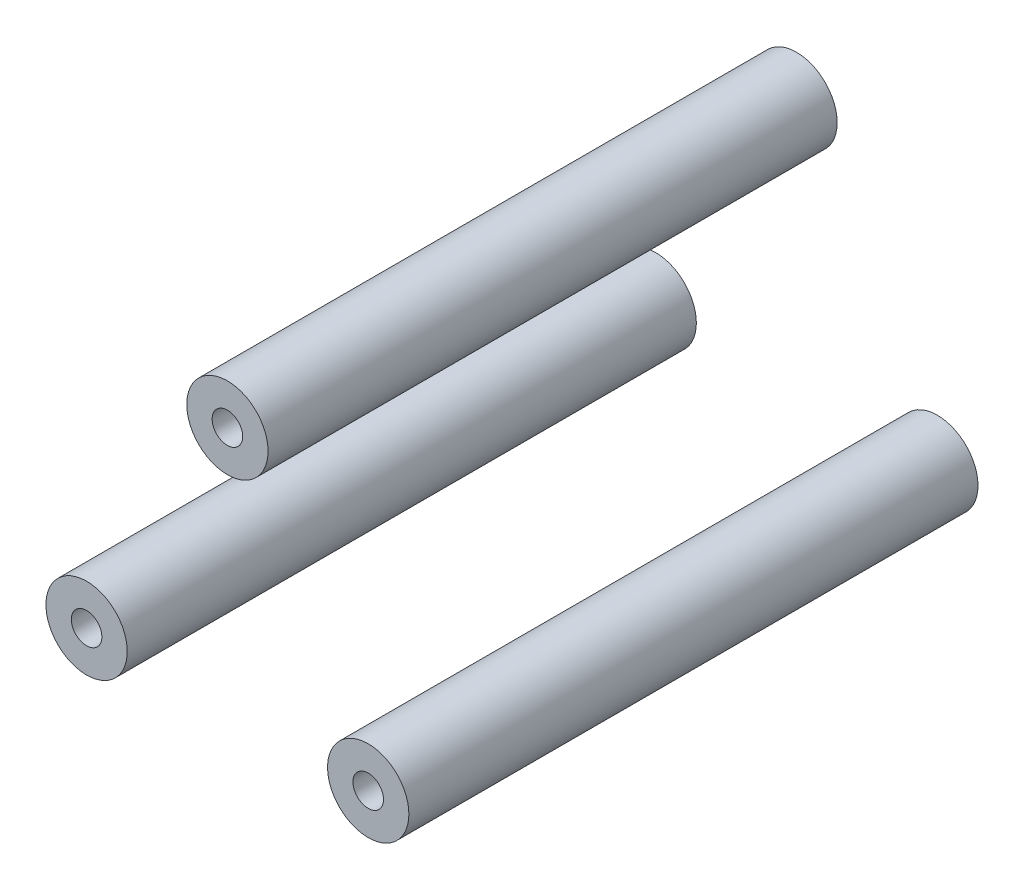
from build123d import *

# Parameters (mm, degrees)
SKETCH2_R             = 6.35
SKETCH2_R_2           = 2.3876
BOSS_EXTRUDE1_DEPTH   = 88.9
BOSS_EXTRUDE1_2_DEPTH = 88.9
BOSS_EXTRUDE1_3_DEPTH = 88.9


with BuildPart() as part:
    # Sketch2 → Boss-Extrude1 (new body)
    with BuildSketch(Plane.XY):
        with Locations((-21.997045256, -12.7)):
            Circle(SKETCH2_R)
        with Locations((-21.997045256, -12.7)):
            Circle(SKETCH2_R_2, mode=Mode.SUBTRACT)
    extrude(amount=BOSS_EXTRUDE1_DEPTH)


with BuildPart() as body_2:
    # Sketch2 → Boss-Extrude1 2 (new body)
    with BuildSketch(Plane.XY):
        with Locations((21.997045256, -12.7)):
            Circle(SKETCH2_R)
        with Locations((21.997045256, -12.7)):
            Circle(SKETCH2_R_2, mode=Mode.SUBTRACT)
    extrude(amount=BOSS_EXTRUDE1_2_DEPTH)


with BuildPart() as body_3:
    # Sketch2 → Boss-Extrude1 3 (new body)
    with BuildSketch(Plane.XY):
        with Locations((0, 25.4)):
            Circle(SKETCH2_R)
        with Locations((0, 25.4)):
            Circle(SKETCH2_R_2, mode=Mode.SUBTRACT)
    extrude(amount=BOSS_EXTRUDE1_3_DEPTH)


solid = Compound([part.part, body_2.part, body_3.part])
